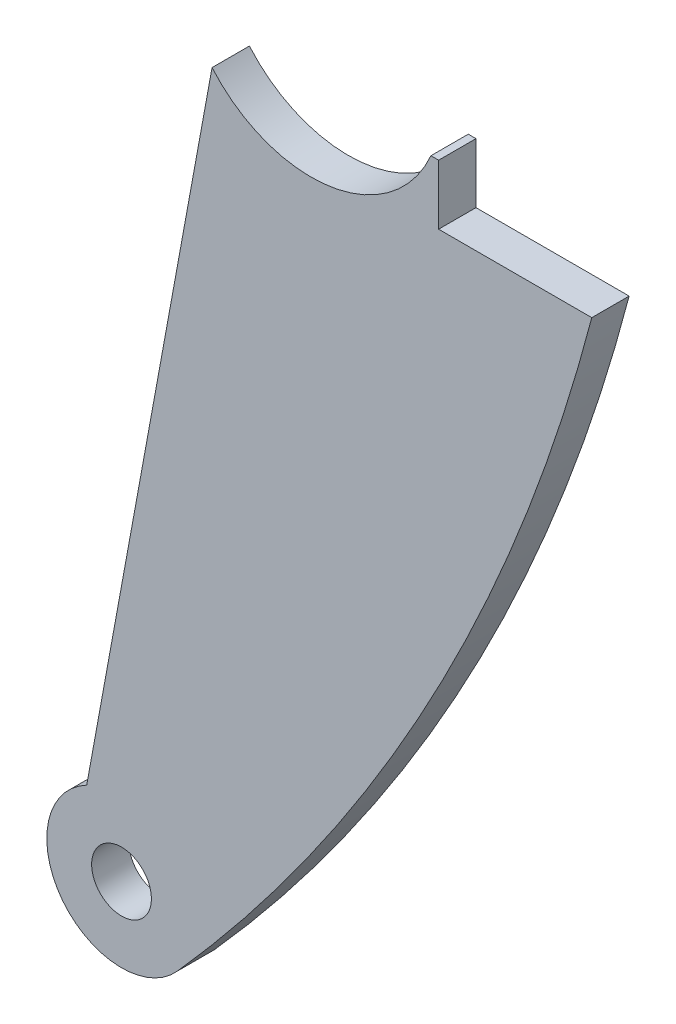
ISO-10303-21;
HEADER;
FILE_DESCRIPTION(('STEP AP214'),'2;1');
FILE_NAME('part.step','',(''),(''),'','','');
FILE_SCHEMA(('AUTOMOTIVE_DESIGN { 1 0 10303 214 1 1 1 1 }'));
ENDSEC;
DATA;
#1=APPLICATION_CONTEXT('core data for automotive mechanical design processes');
#2=APPLICATION_PROTOCOL_DEFINITION('international standard','automotive_design',2000,#1);
#3=PRODUCT_CONTEXT('',#1,'mechanical');
#4=PRODUCT('Part','Part','',(#3));
#5=PRODUCT_RELATED_PRODUCT_CATEGORY('part','',(#4));
#6=PRODUCT_DEFINITION_FORMATION('','',#4);
#7=PRODUCT_DEFINITION_CONTEXT('part definition',#1,'design');
#8=PRODUCT_DEFINITION('design','',#6,#7);
#9=PRODUCT_DEFINITION_SHAPE('','',#8);
#10=(LENGTH_UNIT() NAMED_UNIT(*) SI_UNIT(.MILLI.,.METRE.));
#11=(NAMED_UNIT(*) PLANE_ANGLE_UNIT() SI_UNIT($,.RADIAN.));
#12=(NAMED_UNIT(*) SI_UNIT($,.STERADIAN.) SOLID_ANGLE_UNIT());
#13=UNCERTAINTY_MEASURE_WITH_UNIT(LENGTH_MEASURE(1.E-05),#10,'distance_accuracy_value','');
#14=(GEOMETRIC_REPRESENTATION_CONTEXT(3) GLOBAL_UNCERTAINTY_ASSIGNED_CONTEXT((#13)) GLOBAL_UNIT_ASSIGNED_CONTEXT((#10,
#11,#12)) REPRESENTATION_CONTEXT('',''));
#15=CARTESIAN_POINT('',(0.,0.,0.));
#16=DIRECTION('',(0.,0.,1.));
#17=DIRECTION('',(1.,0.,0.));
#18=AXIS2_PLACEMENT_3D('',#15,#16,#17);
#19=CARTESIAN_POINT('',(-204.343000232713,48.0693610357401,2.5));
#20=DIRECTION('',(0.,0.,1.));
#21=DIRECTION('',(1.,0.,0.));
#22=AXIS2_PLACEMENT_3D('',#19,#20,#21);
#23=PLANE('',#22);
#24=DIRECTION('',(0.,1.,0.));
#25=VECTOR('',#24,1.);
#26=CARTESIAN_POINT('',(17.0707358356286,-7.00000000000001,2.50000000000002));
#27=LINE('',#26,#25);
#28=CARTESIAN_POINT('',(17.0707358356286,-15.,2.5));
#29=VERTEX_POINT('',#28);
#30=CARTESIAN_POINT('',(17.0707358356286,-7.00000000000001,2.50000000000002));
#31=VERTEX_POINT('',#30);
#32=EDGE_CURVE('E134',#29,#31,#27,.T.);
#33=ORIENTED_EDGE('',*,*,#32,.T.);
#34=DIRECTION('',(-1.,0.,0.));
#35=VECTOR('',#34,1.);
#36=CARTESIAN_POINT('',(17.0707358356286,-7.00000000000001,2.50000000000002));
#37=LINE('',#36,#35);
#38=CARTESIAN_POINT('',(16.0390149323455,-7.00000000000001,2.5));
#39=VERTEX_POINT('',#38);
#40=EDGE_CURVE('E87',#31,#39,#37,.T.);
#41=ORIENTED_EDGE('',*,*,#40,.T.);
#42=CARTESIAN_POINT('',(0.,0.,2.49999999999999));
#43=DIRECTION('',(0.,0.,-1.));
#44=DIRECTION('',(1.,0.,0.));
#45=AXIS2_PLACEMENT_3D('',#42,#43,#44);
#46=CIRCLE('',#45,17.5);
#47=CARTESIAN_POINT('',(-13.2540062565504,-11.4272183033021,2.5));
#48=VERTEX_POINT('',#47);
#49=EDGE_CURVE('E146',#39,#48,#46,.T.);
#50=ORIENTED_EDGE('',*,*,#49,.T.);
#51=DIRECTION('',(-0.180217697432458,-0.983626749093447,0.));
#52=VECTOR('',#51,1.);
#53=CARTESIAN_POINT('',(-13.2540062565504,-11.4272183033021,2.5));
#54=LINE('',#53,#52);
#55=CARTESIAN_POINT('',(-30.0290318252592,-102.985173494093,2.50000000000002));
#56=VERTEX_POINT('',#55);
#57=EDGE_CURVE('E103',#48,#56,#54,.T.);
#58=ORIENTED_EDGE('',*,*,#57,.T.);
#59=CARTESIAN_POINT('',(-25.3714217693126,-111.834279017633,2.49999999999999));
#60=DIRECTION('',(0.,0.,1.));
#61=DIRECTION('',(-1.,0.,0.));
#62=AXIS2_PLACEMENT_3D('',#59,#60,#61);
#63=CIRCLE('',#62,9.99999999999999);
#64=CARTESIAN_POINT('',(-17.9142726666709,-118.496930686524,2.50000000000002));
#65=VERTEX_POINT('',#64);
#66=EDGE_CURVE('E97',#56,#65,#63,.T.);
#67=ORIENTED_EDGE('',*,*,#66,.T.);
#68=CARTESIAN_POINT('',(-204.343000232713,48.0693610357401,2.5));
#69=DIRECTION('',(0.,0.,1.));
#70=DIRECTION('',(1.,0.,0.));
#71=AXIS2_PLACEMENT_3D('',#68,#69,#70);
#72=CIRCLE('',#71,250.);
#73=CARTESIAN_POINT('',(37.5707358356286,-15.,2.5));
#74=VERTEX_POINT('',#73);
#75=EDGE_CURVE('E101',#65,#74,#72,.T.);
#76=ORIENTED_EDGE('',*,*,#75,.T.);
#77=DIRECTION('',(-1.,0.,0.));
#78=VECTOR('',#77,1.);
#79=CARTESIAN_POINT('',(37.5707358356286,-15.,2.5));
#80=LINE('',#79,#78);
#81=EDGE_CURVE('E47',#74,#29,#80,.T.);
#82=ORIENTED_EDGE('',*,*,#81,.T.);
#83=EDGE_LOOP('',(#33,#41,#50,#58,#67,#76,#82));
#84=FACE_BOUND('',#83,.T.);
#85=CARTESIAN_POINT('',(-25.3714217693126,-111.834279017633,2.49999999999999));
#86=DIRECTION('',(0.,0.,1.));
#87=DIRECTION('',(1.,0.,0.));
#88=AXIS2_PLACEMENT_3D('',#85,#86,#87);
#89=CIRCLE('',#88,4.00000000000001);
#90=CARTESIAN_POINT('',(-21.3714217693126,-111.834279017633,2.49999999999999));
#91=VERTEX_POINT('',#90);
#92=EDGE_CURVE('E125',#91,#91,#89,.T.);
#93=ORIENTED_EDGE('',*,*,#92,.F.);
#94=EDGE_LOOP('',(#93));
#95=FACE_BOUND('',#94,.T.);
#96=ADVANCED_FACE('F30',(#84,#95),#23,.T.);
#97=CARTESIAN_POINT('',(-204.343000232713,48.0693610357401,-2.5));
#98=DIRECTION('',(0.,0.,1.));
#99=DIRECTION('',(1.,0.,0.));
#100=AXIS2_PLACEMENT_3D('',#97,#98,#99);
#101=PLANE('',#100);
#102=DIRECTION('',(0.,1.,0.));
#103=VECTOR('',#102,1.);
#104=CARTESIAN_POINT('',(17.0707358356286,-6.99999999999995,-2.5));
#105=LINE('',#104,#103);
#106=CARTESIAN_POINT('',(17.0707358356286,-15.,-2.49999999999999));
#107=VERTEX_POINT('',#106);
#108=CARTESIAN_POINT('',(17.0707358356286,-6.99999999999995,-2.5));
#109=VERTEX_POINT('',#108);
#110=EDGE_CURVE('E121',#107,#109,#105,.T.);
#111=ORIENTED_EDGE('',*,*,#110,.F.);
#112=DIRECTION('',(-1.,0.,0.));
#113=VECTOR('',#112,1.);
#114=CARTESIAN_POINT('',(37.5707358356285,-15.,-2.50000000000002));
#115=LINE('',#114,#113);
#116=CARTESIAN_POINT('',(37.5707358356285,-15.,-2.50000000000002));
#117=VERTEX_POINT('',#116);
#118=EDGE_CURVE('E79',#117,#107,#115,.T.);
#119=ORIENTED_EDGE('',*,*,#118,.F.);
#120=CARTESIAN_POINT('',(-204.343000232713,48.0693610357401,-2.5));
#121=DIRECTION('',(0.,0.,1.));
#122=DIRECTION('',(1.,0.,0.));
#123=AXIS2_PLACEMENT_3D('',#120,#121,#122);
#124=CIRCLE('',#123,250.);
#125=CARTESIAN_POINT('',(-17.9142726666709,-118.496930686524,-2.49999999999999));
#126=VERTEX_POINT('',#125);
#127=EDGE_CURVE('E73',#126,#117,#124,.T.);
#128=ORIENTED_EDGE('',*,*,#127,.F.);
#129=CARTESIAN_POINT('',(-25.3714217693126,-111.834279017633,-2.50000000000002));
#130=DIRECTION('',(0.,0.,1.));
#131=DIRECTION('',(-1.,0.,0.));
#132=AXIS2_PLACEMENT_3D('',#129,#130,#131);
#133=CIRCLE('',#132,9.99999999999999);
#134=CARTESIAN_POINT('',(-30.0290318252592,-102.985173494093,-2.49999999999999));
#135=VERTEX_POINT('',#134);
#136=EDGE_CURVE('E111',#135,#126,#133,.T.);
#137=ORIENTED_EDGE('',*,*,#136,.F.);
#138=DIRECTION('',(-0.180217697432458,-0.983626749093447,0.));
#139=VECTOR('',#138,1.);
#140=CARTESIAN_POINT('',(-13.2540062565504,-11.4272183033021,-2.49999999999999));
#141=LINE('',#140,#139);
#142=CARTESIAN_POINT('',(-13.2540062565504,-11.4272183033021,-2.49999999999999));
#143=VERTEX_POINT('',#142);
#144=EDGE_CURVE('E129',#143,#135,#141,.T.);
#145=ORIENTED_EDGE('',*,*,#144,.F.);
#146=CARTESIAN_POINT('',(0.,0.,-2.49999999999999));
#147=DIRECTION('',(0.,0.,-1.));
#148=DIRECTION('',(1.,0.,0.));
#149=AXIS2_PLACEMENT_3D('',#146,#147,#148);
#150=CIRCLE('',#149,17.5);
#151=CARTESIAN_POINT('',(16.0390149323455,-7.00000000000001,-2.50000000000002));
#152=VERTEX_POINT('',#151);
#153=EDGE_CURVE('E127',#152,#143,#150,.T.);
#154=ORIENTED_EDGE('',*,*,#153,.F.);
#155=DIRECTION('',(-1.,0.,0.));
#156=VECTOR('',#155,1.);
#157=CARTESIAN_POINT('',(17.0707358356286,-6.99999999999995,-2.5));
#158=LINE('',#157,#156);
#159=EDGE_CURVE('E124',#109,#152,#158,.T.);
#160=ORIENTED_EDGE('',*,*,#159,.F.);
#161=EDGE_LOOP('',(#111,#119,#128,#137,#145,#154,#160));
#162=FACE_BOUND('',#161,.T.);
#163=CARTESIAN_POINT('',(-25.3714217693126,-111.834279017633,-2.50000000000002));
#164=DIRECTION('',(0.,0.,1.));
#165=DIRECTION('',(1.,0.,0.));
#166=AXIS2_PLACEMENT_3D('',#163,#164,#165);
#167=CIRCLE('',#166,4.00000000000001);
#168=CARTESIAN_POINT('',(-21.3714217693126,-111.834279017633,-2.50000000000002));
#169=VERTEX_POINT('',#168);
#170=EDGE_CURVE('E158',#169,#169,#167,.T.);
#171=ORIENTED_EDGE('',*,*,#170,.T.);
#172=EDGE_LOOP('',(#171));
#173=FACE_BOUND('',#172,.T.);
#174=ADVANCED_FACE('F150',(#162,#173),#101,.F.);
#175=CARTESIAN_POINT('',(17.0707358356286,-7.00000000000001,2.50000000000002));
#176=DIRECTION('',(-1.,0.,0.));
#177=DIRECTION('',(0.,-1.,0.));
#178=AXIS2_PLACEMENT_3D('',#175,#176,#177);
#179=PLANE('',#178);
#180=ORIENTED_EDGE('',*,*,#110,.T.);
#181=DIRECTION('',(0.,0.,-1.));
#182=VECTOR('',#181,1.);
#183=CARTESIAN_POINT('',(17.0707358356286,-7.00000000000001,2.50000000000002));
#184=LINE('',#183,#182);
#185=EDGE_CURVE('E11',#31,#109,#184,.T.);
#186=ORIENTED_EDGE('',*,*,#185,.F.);
#187=ORIENTED_EDGE('',*,*,#32,.F.);
#188=DIRECTION('',(0.,0.,-1.));
#189=VECTOR('',#188,1.);
#190=CARTESIAN_POINT('',(17.0707358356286,-15.,2.5));
#191=LINE('',#190,#189);
#192=EDGE_CURVE('E117',#29,#107,#191,.T.);
#193=ORIENTED_EDGE('',*,*,#192,.T.);
#194=EDGE_LOOP('',(#180,#186,#187,#193));
#195=FACE_BOUND('',#194,.T.);
#196=ADVANCED_FACE('F32',(#195),#179,.F.);
#197=CARTESIAN_POINT('',(17.0707358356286,-7.00000000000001,2.50000000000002));
#198=DIRECTION('',(0.,-1.,0.));
#199=DIRECTION('',(0.,0.,-1.));
#200=AXIS2_PLACEMENT_3D('',#197,#198,#199);
#201=PLANE('',#200);
#202=ORIENTED_EDGE('',*,*,#159,.T.);
#203=DIRECTION('',(0.,0.,-1.));
#204=VECTOR('',#203,1.);
#205=CARTESIAN_POINT('',(16.0390149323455,-7.00000000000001,2.5));
#206=LINE('',#205,#204);
#207=EDGE_CURVE('E39',#39,#152,#206,.T.);
#208=ORIENTED_EDGE('',*,*,#207,.F.);
#209=ORIENTED_EDGE('',*,*,#40,.F.);
#210=ORIENTED_EDGE('',*,*,#185,.T.);
#211=EDGE_LOOP('',(#202,#208,#209,#210));
#212=FACE_BOUND('',#211,.T.);
#213=ADVANCED_FACE('F184',(#212),#201,.F.);
#214=CARTESIAN_POINT('',(0.,0.,2.49999999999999));
#215=DIRECTION('',(0.,0.,-1.));
#216=DIRECTION('',(-1.,0.,0.));
#217=AXIS2_PLACEMENT_3D('',#214,#215,#216);
#218=CYLINDRICAL_SURFACE('',#217,17.5);
#219=ORIENTED_EDGE('',*,*,#153,.T.);
#220=DIRECTION('',(0.,0.,-1.));
#221=VECTOR('',#220,1.);
#222=CARTESIAN_POINT('',(-13.2540062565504,-11.4272183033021,2.5));
#223=LINE('',#222,#221);
#224=EDGE_CURVE('E138',#48,#143,#223,.T.);
#225=ORIENTED_EDGE('',*,*,#224,.F.);
#226=ORIENTED_EDGE('',*,*,#49,.F.);
#227=ORIENTED_EDGE('',*,*,#207,.T.);
#228=EDGE_LOOP('',(#219,#225,#226,#227));
#229=FACE_BOUND('',#228,.T.);
#230=ADVANCED_FACE('F144',(#229),#218,.F.);
#231=CARTESIAN_POINT('',(-13.2540062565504,-11.4272183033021,2.5));
#232=DIRECTION('',(0.983626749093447,-0.180217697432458,0.));
#233=DIRECTION('',(0.180217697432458,0.983626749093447,0.));
#234=AXIS2_PLACEMENT_3D('',#231,#232,#233);
#235=PLANE('',#234);
#236=ORIENTED_EDGE('',*,*,#144,.T.);
#237=DIRECTION('',(0.,0.,-1.));
#238=VECTOR('',#237,1.);
#239=CARTESIAN_POINT('',(-30.0290318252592,-102.985173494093,2.50000000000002));
#240=LINE('',#239,#238);
#241=EDGE_CURVE('E112',#56,#135,#240,.T.);
#242=ORIENTED_EDGE('',*,*,#241,.F.);
#243=ORIENTED_EDGE('',*,*,#57,.F.);
#244=ORIENTED_EDGE('',*,*,#224,.T.);
#245=EDGE_LOOP('',(#236,#242,#243,#244));
#246=FACE_BOUND('',#245,.T.);
#247=ADVANCED_FACE('F153',(#246),#235,.F.);
#248=CARTESIAN_POINT('',(-25.3714217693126,-111.834279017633,2.49999999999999));
#249=DIRECTION('',(0.,0.,-1.));
#250=DIRECTION('',(-1.,0.,0.));
#251=AXIS2_PLACEMENT_3D('',#248,#249,#250);
#252=CYLINDRICAL_SURFACE('',#251,9.99999999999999);
#253=ORIENTED_EDGE('',*,*,#136,.T.);
#254=DIRECTION('',(0.,0.,-1.));
#255=VECTOR('',#254,1.);
#256=CARTESIAN_POINT('',(-17.9142726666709,-118.496930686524,2.50000000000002));
#257=LINE('',#256,#255);
#258=EDGE_CURVE('E108',#65,#126,#257,.T.);
#259=ORIENTED_EDGE('',*,*,#258,.F.);
#260=ORIENTED_EDGE('',*,*,#66,.F.);
#261=ORIENTED_EDGE('',*,*,#241,.T.);
#262=EDGE_LOOP('',(#253,#259,#260,#261));
#263=FACE_BOUND('',#262,.T.);
#264=ADVANCED_FACE('F109',(#263),#252,.T.);
#265=CARTESIAN_POINT('',(-204.343000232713,48.0693610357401,2.5));
#266=DIRECTION('',(0.,0.,-1.));
#267=DIRECTION('',(-1.,0.,0.));
#268=AXIS2_PLACEMENT_3D('',#265,#266,#267);
#269=CYLINDRICAL_SURFACE('',#268,250.);
#270=ORIENTED_EDGE('',*,*,#127,.T.);
#271=DIRECTION('',(0.,0.,-1.));
#272=VECTOR('',#271,1.);
#273=CARTESIAN_POINT('',(37.5707358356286,-15.,2.5));
#274=LINE('',#273,#272);
#275=EDGE_CURVE('E113',#74,#117,#274,.T.);
#276=ORIENTED_EDGE('',*,*,#275,.F.);
#277=ORIENTED_EDGE('',*,*,#75,.F.);
#278=ORIENTED_EDGE('',*,*,#258,.T.);
#279=EDGE_LOOP('',(#270,#276,#277,#278));
#280=FACE_BOUND('',#279,.T.);
#281=ADVANCED_FACE('F115',(#280),#269,.T.);
#282=CARTESIAN_POINT('',(37.5707358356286,-15.,2.5));
#283=DIRECTION('',(0.,-1.,0.));
#284=DIRECTION('',(0.,0.,-1.));
#285=AXIS2_PLACEMENT_3D('',#282,#283,#284);
#286=PLANE('',#285);
#287=ORIENTED_EDGE('',*,*,#118,.T.);
#288=ORIENTED_EDGE('',*,*,#192,.F.);
#289=ORIENTED_EDGE('',*,*,#81,.F.);
#290=ORIENTED_EDGE('',*,*,#275,.T.);
#291=EDGE_LOOP('',(#287,#288,#289,#290));
#292=FACE_BOUND('',#291,.T.);
#293=ADVANCED_FACE('F174',(#292),#286,.F.);
#294=CARTESIAN_POINT('',(-25.3714217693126,-111.834279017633,2.49999999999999));
#295=DIRECTION('',(0.,0.,-1.));
#296=DIRECTION('',(-1.,0.,0.));
#297=AXIS2_PLACEMENT_3D('',#294,#295,#296);
#298=CYLINDRICAL_SURFACE('',#297,4.00000000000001);
#299=ORIENTED_EDGE('',*,*,#92,.T.);
#300=EDGE_LOOP('',(#299));
#301=FACE_BOUND('',#300,.T.);
#302=ORIENTED_EDGE('',*,*,#170,.F.);
#303=EDGE_LOOP('',(#302));
#304=FACE_BOUND('',#303,.T.);
#305=ADVANCED_FACE('F164',(#301,#304),#298,.F.);
#306=CLOSED_SHELL('',(#96,#174,#196,#213,#230,#247,#264,#281,#293,#305));
#307=MANIFOLD_SOLID_BREP('B2',#306);
#308=ADVANCED_BREP_SHAPE_REPRESENTATION('',(#18,#307),#14);
#309=SHAPE_DEFINITION_REPRESENTATION(#9,#308);
ENDSEC;
END-ISO-10303-21;
